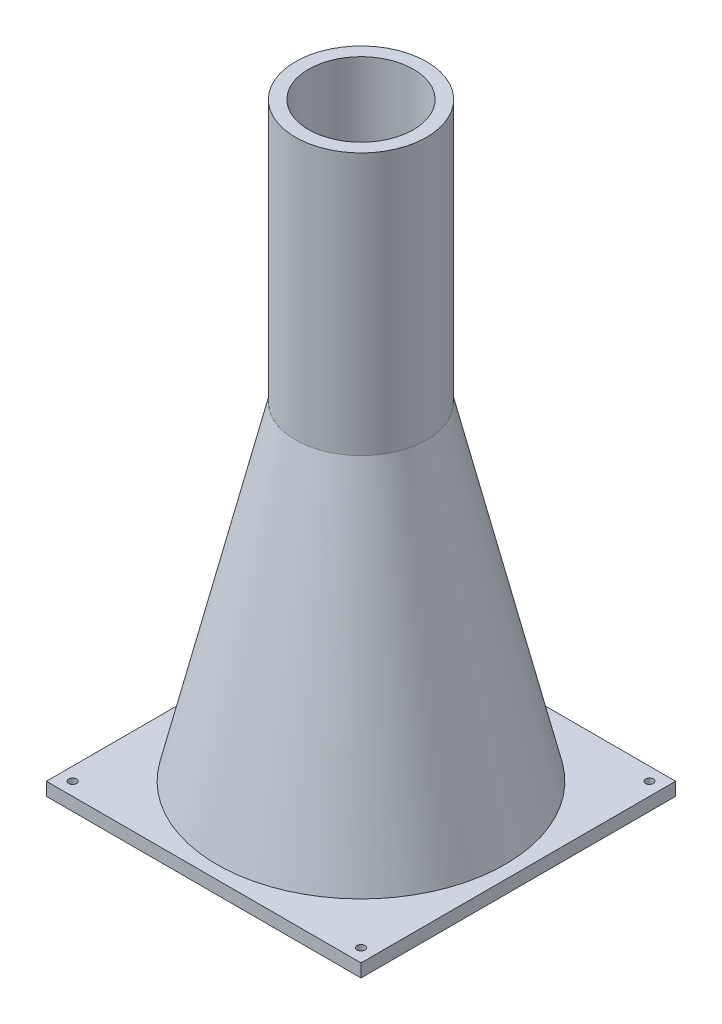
ISO-10303-21;
HEADER;
FILE_DESCRIPTION(('STEP AP214'),'2;1');
FILE_NAME('part.step','',(''),(''),'','','');
FILE_SCHEMA(('AUTOMOTIVE_DESIGN { 1 0 10303 214 1 1 1 1 }'));
ENDSEC;
DATA;
#1=APPLICATION_CONTEXT('core data for automotive mechanical design processes');
#2=APPLICATION_PROTOCOL_DEFINITION('international standard','automotive_design',2000,#1);
#3=PRODUCT_CONTEXT('',#1,'mechanical');
#4=PRODUCT('Part','Part','',(#3));
#5=PRODUCT_RELATED_PRODUCT_CATEGORY('part','',(#4));
#6=PRODUCT_DEFINITION_FORMATION('','',#4);
#7=PRODUCT_DEFINITION_CONTEXT('part definition',#1,'design');
#8=PRODUCT_DEFINITION('design','',#6,#7);
#9=PRODUCT_DEFINITION_SHAPE('','',#8);
#10=(LENGTH_UNIT() NAMED_UNIT(*) SI_UNIT(.MILLI.,.METRE.));
#11=(NAMED_UNIT(*) PLANE_ANGLE_UNIT() SI_UNIT($,.RADIAN.));
#12=(NAMED_UNIT(*) SI_UNIT($,.STERADIAN.) SOLID_ANGLE_UNIT());
#13=UNCERTAINTY_MEASURE_WITH_UNIT(LENGTH_MEASURE(1.E-05),#10,'distance_accuracy_value','');
#14=(GEOMETRIC_REPRESENTATION_CONTEXT(3) GLOBAL_UNCERTAINTY_ASSIGNED_CONTEXT((#13)) GLOBAL_UNIT_ASSIGNED_CONTEXT((#10,
#11,#12)) REPRESENTATION_CONTEXT('',''));
#15=CARTESIAN_POINT('',(0.,0.,0.));
#16=DIRECTION('',(0.,0.,1.));
#17=DIRECTION('',(1.,0.,0.));
#18=AXIS2_PLACEMENT_3D('',#15,#16,#17);
#19=CARTESIAN_POINT('',(-20.,225.212863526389,0.));
#20=DIRECTION('',(0.,-1.,0.));
#21=DIRECTION('',(0.,0.,-1.));
#22=AXIS2_PLACEMENT_3D('',#19,#20,#21);
#23=PLANE('',#22);
#24=CARTESIAN_POINT('',(0.,225.212863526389,0.));
#25=DIRECTION('',(0.,-1.,0.));
#26=DIRECTION('',(0.,0.,-1.));
#27=AXIS2_PLACEMENT_3D('',#24,#25,#26);
#28=CIRCLE('',#27,25.);
#29=CARTESIAN_POINT('',(0.,225.212863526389,-25.));
#30=VERTEX_POINT('',#29);
#31=EDGE_CURVE('E11',#30,#30,#28,.T.);
#32=ORIENTED_EDGE('',*,*,#31,.F.);
#33=EDGE_LOOP('',(#32));
#34=FACE_BOUND('',#33,.T.);
#35=CARTESIAN_POINT('',(0.,225.212863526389,0.));
#36=DIRECTION('',(0.,-1.,0.));
#37=DIRECTION('',(0.,0.,-1.));
#38=AXIS2_PLACEMENT_3D('',#35,#36,#37);
#39=CIRCLE('',#38,20.);
#40=CARTESIAN_POINT('',(0.,225.212863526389,-20.));
#41=VERTEX_POINT('',#40);
#42=EDGE_CURVE('E110',#41,#41,#39,.T.);
#43=ORIENTED_EDGE('',*,*,#42,.T.);
#44=EDGE_LOOP('',(#43));
#45=FACE_BOUND('',#44,.T.);
#46=ADVANCED_FACE('F33',(#34,#45),#23,.F.);
#47=CARTESIAN_POINT('',(0.,0.,0.));
#48=DIRECTION('',(0.,-1.,0.));
#49=DIRECTION('',(0.,0.,-1.));
#50=AXIS2_PLACEMENT_3D('',#47,#48,#49);
#51=CYLINDRICAL_SURFACE('',#50,25.);
#52=CARTESIAN_POINT('',(0.,125.212863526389,0.));
#53=DIRECTION('',(0.,-1.,0.));
#54=DIRECTION('',(0.,0.,-1.));
#55=AXIS2_PLACEMENT_3D('',#52,#53,#54);
#56=CIRCLE('',#55,25.);
#57=CARTESIAN_POINT('',(0.,125.212863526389,-25.));
#58=VERTEX_POINT('',#57);
#59=EDGE_CURVE('E41',#58,#58,#56,.T.);
#60=ORIENTED_EDGE('',*,*,#59,.F.);
#61=EDGE_LOOP('',(#60));
#62=FACE_BOUND('',#61,.T.);
#63=ORIENTED_EDGE('',*,*,#31,.T.);
#64=EDGE_LOOP('',(#63));
#65=FACE_BOUND('',#64,.T.);
#66=ADVANCED_FACE('F123',(#62,#65),#51,.T.);
#67=CARTESIAN_POINT('',(0.,125.212863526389,0.));
#68=DIRECTION('',(0.,-1.,0.));
#69=DIRECTION('',(0.,0.,-1.));
#70=AXIS2_PLACEMENT_3D('',#67,#68,#69);
#71=CONICAL_SURFACE('',#70,25.,0.235159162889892);
#72=CARTESIAN_POINT('',(0.,0.,0.));
#73=DIRECTION('',(0.,-1.,0.));
#74=DIRECTION('',(0.,0.,-1.));
#75=AXIS2_PLACEMENT_3D('',#72,#73,#74);
#76=CIRCLE('',#75,55.);
#77=CARTESIAN_POINT('',(0.,0.,-55.));
#78=VERTEX_POINT('',#77);
#79=EDGE_CURVE('E116',#78,#78,#76,.T.);
#80=ORIENTED_EDGE('',*,*,#79,.F.);
#81=EDGE_LOOP('',(#80));
#82=FACE_BOUND('',#81,.T.);
#83=ORIENTED_EDGE('',*,*,#59,.T.);
#84=EDGE_LOOP('',(#83));
#85=FACE_BOUND('',#84,.T.);
#86=ADVANCED_FACE('F121',(#82,#85),#71,.T.);
#87=CARTESIAN_POINT('',(0.,0.,0.));
#88=DIRECTION('',(0.,-1.,0.));
#89=DIRECTION('',(0.,0.,-1.));
#90=AXIS2_PLACEMENT_3D('',#87,#88,#89);
#91=CONICAL_SURFACE('',#90,50.,0.235159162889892);
#92=CARTESIAN_POINT('',(0.,125.212863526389,0.));
#93=DIRECTION('',(0.,-1.,0.));
#94=DIRECTION('',(0.,0.,-1.));
#95=AXIS2_PLACEMENT_3D('',#92,#93,#94);
#96=CIRCLE('',#95,20.);
#97=CARTESIAN_POINT('',(0.,125.212863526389,-20.));
#98=VERTEX_POINT('',#97);
#99=EDGE_CURVE('E113',#98,#98,#96,.T.);
#100=ORIENTED_EDGE('',*,*,#99,.F.);
#101=EDGE_LOOP('',(#100));
#102=FACE_BOUND('',#101,.T.);
#103=CARTESIAN_POINT('',(0.,0.,0.));
#104=DIRECTION('',(0.,1.,0.));
#105=DIRECTION('',(0.,0.,1.));
#106=AXIS2_PLACEMENT_3D('',#103,#104,#105);
#107=CIRCLE('',#106,50.);
#108=CARTESIAN_POINT('',(0.,0.,50.));
#109=VERTEX_POINT('',#108);
#110=EDGE_CURVE('E145',#109,#109,#107,.T.);
#111=ORIENTED_EDGE('',*,*,#110,.F.);
#112=EDGE_LOOP('',(#111));
#113=FACE_BOUND('',#112,.T.);
#114=ADVANCED_FACE('F136',(#102,#113),#91,.F.);
#115=CARTESIAN_POINT('',(0.,0.,0.));
#116=DIRECTION('',(0.,-1.,0.));
#117=DIRECTION('',(0.,0.,-1.));
#118=AXIS2_PLACEMENT_3D('',#115,#116,#117);
#119=CYLINDRICAL_SURFACE('',#118,20.);
#120=ORIENTED_EDGE('',*,*,#42,.F.);
#121=EDGE_LOOP('',(#120));
#122=FACE_BOUND('',#121,.T.);
#123=ORIENTED_EDGE('',*,*,#99,.T.);
#124=EDGE_LOOP('',(#123));
#125=FACE_BOUND('',#124,.T.);
#126=ADVANCED_FACE('F132',(#122,#125),#119,.F.);
#127=CARTESIAN_POINT('',(0.,0.,0.));
#128=DIRECTION('',(0.,1.,0.));
#129=DIRECTION('',(0.,0.,1.));
#130=AXIS2_PLACEMENT_3D('',#127,#128,#129);
#131=PLANE('',#130);
#132=CARTESIAN_POINT('',(-54.9999999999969,0.,-55.));
#133=DIRECTION('',(0.,-1.,0.));
#134=DIRECTION('',(0.,0.,-1.));
#135=AXIS2_PLACEMENT_3D('',#132,#133,#134);
#136=CIRCLE('',#135,1.50000000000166);
#137=CARTESIAN_POINT('',(-54.9999999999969,0.,-56.5000000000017));
#138=VERTEX_POINT('',#137);
#139=EDGE_CURVE('E166',#138,#138,#136,.T.);
#140=ORIENTED_EDGE('',*,*,#139,.T.);
#141=EDGE_LOOP('',(#140));
#142=FACE_BOUND('',#141,.T.);
#143=CARTESIAN_POINT('',(55.0000000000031,0.,-54.9999999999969));
#144=DIRECTION('',(0.,-1.,0.));
#145=DIRECTION('',(0.,0.,-1.));
#146=AXIS2_PLACEMENT_3D('',#143,#144,#145);
#147=CIRCLE('',#146,1.5000000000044);
#148=CARTESIAN_POINT('',(55.0000000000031,0.,-56.5000000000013));
#149=VERTEX_POINT('',#148);
#150=EDGE_CURVE('E160',#149,#149,#147,.T.);
#151=ORIENTED_EDGE('',*,*,#150,.T.);
#152=EDGE_LOOP('',(#151));
#153=FACE_BOUND('',#152,.T.);
#154=CARTESIAN_POINT('',(55.,0.,55.0000000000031));
#155=DIRECTION('',(0.,-1.,0.));
#156=DIRECTION('',(0.,0.,-1.));
#157=AXIS2_PLACEMENT_3D('',#154,#155,#156);
#158=CIRCLE('',#157,1.50000000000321);
#159=CARTESIAN_POINT('',(55.,0.,53.4999999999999));
#160=VERTEX_POINT('',#159);
#161=EDGE_CURVE('E153',#160,#160,#158,.T.);
#162=ORIENTED_EDGE('',*,*,#161,.T.);
#163=EDGE_LOOP('',(#162));
#164=FACE_BOUND('',#163,.T.);
#165=CARTESIAN_POINT('',(-55.,0.,55.));
#166=DIRECTION('',(0.,-1.,0.));
#167=DIRECTION('',(0.,0.,-1.));
#168=AXIS2_PLACEMENT_3D('',#165,#166,#167);
#169=CIRCLE('',#168,1.5);
#170=CARTESIAN_POINT('',(-55.,0.,53.5));
#171=VERTEX_POINT('',#170);
#172=EDGE_CURVE('E103',#171,#171,#169,.T.);
#173=ORIENTED_EDGE('',*,*,#172,.T.);
#174=EDGE_LOOP('',(#173));
#175=FACE_BOUND('',#174,.T.);
#176=ORIENTED_EDGE('',*,*,#79,.T.);
#177=EDGE_LOOP('',(#176));
#178=FACE_BOUND('',#177,.T.);
#179=DIRECTION('',(0.,0.,1.));
#180=VECTOR('',#179,1.);
#181=CARTESIAN_POINT('',(60.,0.,-60.));
#182=LINE('',#181,#180);
#183=CARTESIAN_POINT('',(60.,0.,-60.));
#184=VERTEX_POINT('',#183);
#185=CARTESIAN_POINT('',(60.,0.,60.));
#186=VERTEX_POINT('',#185);
#187=EDGE_CURVE('E100',#184,#186,#182,.T.);
#188=ORIENTED_EDGE('',*,*,#187,.F.);
#189=DIRECTION('',(1.,0.,0.));
#190=VECTOR('',#189,1.);
#191=CARTESIAN_POINT('',(-60.,0.,-60.));
#192=LINE('',#191,#190);
#193=CARTESIAN_POINT('',(-60.,0.,-60.));
#194=VERTEX_POINT('',#193);
#195=EDGE_CURVE('E72',#194,#184,#192,.T.);
#196=ORIENTED_EDGE('',*,*,#195,.F.);
#197=DIRECTION('',(0.,0.,-1.));
#198=VECTOR('',#197,1.);
#199=CARTESIAN_POINT('',(-60.,0.,-60.));
#200=LINE('',#199,#198);
#201=CARTESIAN_POINT('',(-60.,0.,60.));
#202=VERTEX_POINT('',#201);
#203=EDGE_CURVE('E66',#202,#194,#200,.T.);
#204=ORIENTED_EDGE('',*,*,#203,.F.);
#205=DIRECTION('',(-1.,0.,0.));
#206=VECTOR('',#205,1.);
#207=CARTESIAN_POINT('',(-60.,0.,60.));
#208=LINE('',#207,#206);
#209=EDGE_CURVE('E90',#186,#202,#208,.T.);
#210=ORIENTED_EDGE('',*,*,#209,.F.);
#211=EDGE_LOOP('',(#188,#196,#204,#210));
#212=FACE_BOUND('',#211,.T.);
#213=ADVANCED_FACE('F135',(#142,#153,#164,#175,#178,#212),#131,.T.);
#214=CARTESIAN_POINT('',(0.,-5.,0.));
#215=DIRECTION('',(0.,1.,0.));
#216=DIRECTION('',(0.,0.,1.));
#217=AXIS2_PLACEMENT_3D('',#214,#215,#216);
#218=PLANE('',#217);
#219=CARTESIAN_POINT('',(0.,-5.,0.));
#220=DIRECTION('',(0.,1.,0.));
#221=DIRECTION('',(0.,0.,1.));
#222=AXIS2_PLACEMENT_3D('',#219,#220,#221);
#223=CIRCLE('',#222,50.);
#224=CARTESIAN_POINT('',(0.,-5.,50.));
#225=VERTEX_POINT('',#224);
#226=EDGE_CURVE('E147',#225,#225,#223,.T.);
#227=ORIENTED_EDGE('',*,*,#226,.T.);
#228=EDGE_LOOP('',(#227));
#229=FACE_BOUND('',#228,.T.);
#230=CARTESIAN_POINT('',(-54.9999999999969,-5.,-55.));
#231=DIRECTION('',(0.,-1.,0.));
#232=DIRECTION('',(0.,0.,-1.));
#233=AXIS2_PLACEMENT_3D('',#230,#231,#232);
#234=CIRCLE('',#233,1.50000000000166);
#235=CARTESIAN_POINT('',(-54.9999999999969,-5.,-56.5000000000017));
#236=VERTEX_POINT('',#235);
#237=EDGE_CURVE('E150',#236,#236,#234,.T.);
#238=ORIENTED_EDGE('',*,*,#237,.F.);
#239=EDGE_LOOP('',(#238));
#240=FACE_BOUND('',#239,.T.);
#241=CARTESIAN_POINT('',(55.0000000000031,-5.,-54.9999999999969));
#242=DIRECTION('',(0.,-1.,0.));
#243=DIRECTION('',(0.,0.,-1.));
#244=AXIS2_PLACEMENT_3D('',#241,#242,#243);
#245=CIRCLE('',#244,1.5000000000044);
#246=CARTESIAN_POINT('',(55.0000000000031,-5.,-56.5000000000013));
#247=VERTEX_POINT('',#246);
#248=EDGE_CURVE('E163',#247,#247,#245,.T.);
#249=ORIENTED_EDGE('',*,*,#248,.F.);
#250=EDGE_LOOP('',(#249));
#251=FACE_BOUND('',#250,.T.);
#252=CARTESIAN_POINT('',(55.,-5.,55.0000000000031));
#253=DIRECTION('',(0.,-1.,0.));
#254=DIRECTION('',(0.,0.,-1.));
#255=AXIS2_PLACEMENT_3D('',#252,#253,#254);
#256=CIRCLE('',#255,1.50000000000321);
#257=CARTESIAN_POINT('',(55.,-5.,53.4999999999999));
#258=VERTEX_POINT('',#257);
#259=EDGE_CURVE('E157',#258,#258,#256,.T.);
#260=ORIENTED_EDGE('',*,*,#259,.F.);
#261=EDGE_LOOP('',(#260));
#262=FACE_BOUND('',#261,.T.);
#263=CARTESIAN_POINT('',(-55.,-5.,55.));
#264=DIRECTION('',(0.,-1.,0.));
#265=DIRECTION('',(0.,0.,-1.));
#266=AXIS2_PLACEMENT_3D('',#263,#264,#265);
#267=CIRCLE('',#266,1.5);
#268=CARTESIAN_POINT('',(-55.,-5.,53.5));
#269=VERTEX_POINT('',#268);
#270=EDGE_CURVE('E156',#269,#269,#267,.T.);
#271=ORIENTED_EDGE('',*,*,#270,.F.);
#272=EDGE_LOOP('',(#271));
#273=FACE_BOUND('',#272,.T.);
#274=DIRECTION('',(0.,0.,1.));
#275=VECTOR('',#274,1.);
#276=CARTESIAN_POINT('',(60.,-5.,-60.));
#277=LINE('',#276,#275);
#278=CARTESIAN_POINT('',(60.,-5.,-60.));
#279=VERTEX_POINT('',#278);
#280=CARTESIAN_POINT('',(60.,-5.,60.));
#281=VERTEX_POINT('',#280);
#282=EDGE_CURVE('E85',#279,#281,#277,.T.);
#283=ORIENTED_EDGE('',*,*,#282,.T.);
#284=DIRECTION('',(-1.,0.,0.));
#285=VECTOR('',#284,1.);
#286=CARTESIAN_POINT('',(-60.,-5.,60.));
#287=LINE('',#286,#285);
#288=CARTESIAN_POINT('',(-60.,-5.,60.));
#289=VERTEX_POINT('',#288);
#290=EDGE_CURVE('E80',#281,#289,#287,.T.);
#291=ORIENTED_EDGE('',*,*,#290,.T.);
#292=DIRECTION('',(0.,0.,-1.));
#293=VECTOR('',#292,1.);
#294=CARTESIAN_POINT('',(-60.,-5.,-60.));
#295=LINE('',#294,#293);
#296=CARTESIAN_POINT('',(-60.,-5.,-60.));
#297=VERTEX_POINT('',#296);
#298=EDGE_CURVE('E83',#289,#297,#295,.T.);
#299=ORIENTED_EDGE('',*,*,#298,.T.);
#300=DIRECTION('',(1.,0.,0.));
#301=VECTOR('',#300,1.);
#302=CARTESIAN_POINT('',(-60.,-5.,-60.));
#303=LINE('',#302,#301);
#304=EDGE_CURVE('E49',#297,#279,#303,.T.);
#305=ORIENTED_EDGE('',*,*,#304,.T.);
#306=EDGE_LOOP('',(#283,#291,#299,#305));
#307=FACE_BOUND('',#306,.T.);
#308=ADVANCED_FACE('F81',(#229,#240,#251,#262,#273,#307),#218,.F.);
#309=CARTESIAN_POINT('',(-60.,-5.,-60.));
#310=DIRECTION('',(0.,0.,1.));
#311=DIRECTION('',(1.,0.,0.));
#312=AXIS2_PLACEMENT_3D('',#309,#310,#311);
#313=PLANE('',#312);
#314=ORIENTED_EDGE('',*,*,#195,.T.);
#315=DIRECTION('',(0.,1.,0.));
#316=VECTOR('',#315,1.);
#317=CARTESIAN_POINT('',(60.,-5.,-60.));
#318=LINE('',#317,#316);
#319=EDGE_CURVE('E96',#279,#184,#318,.T.);
#320=ORIENTED_EDGE('',*,*,#319,.F.);
#321=ORIENTED_EDGE('',*,*,#304,.F.);
#322=DIRECTION('',(0.,1.,0.));
#323=VECTOR('',#322,1.);
#324=CARTESIAN_POINT('',(-60.,-5.,-60.));
#325=LINE('',#324,#323);
#326=EDGE_CURVE('E92',#297,#194,#325,.T.);
#327=ORIENTED_EDGE('',*,*,#326,.T.);
#328=EDGE_LOOP('',(#314,#320,#321,#327));
#329=FACE_BOUND('',#328,.T.);
#330=ADVANCED_FACE('F179',(#329),#313,.F.);
#331=CARTESIAN_POINT('',(-60.,-5.,-60.));
#332=DIRECTION('',(1.,0.,0.));
#333=DIRECTION('',(0.,0.,-1.));
#334=AXIS2_PLACEMENT_3D('',#331,#332,#333);
#335=PLANE('',#334);
#336=ORIENTED_EDGE('',*,*,#203,.T.);
#337=ORIENTED_EDGE('',*,*,#326,.F.);
#338=ORIENTED_EDGE('',*,*,#298,.F.);
#339=DIRECTION('',(0.,1.,0.));
#340=VECTOR('',#339,1.);
#341=CARTESIAN_POINT('',(-60.,-5.,60.));
#342=LINE('',#341,#340);
#343=EDGE_CURVE('E88',#289,#202,#342,.T.);
#344=ORIENTED_EDGE('',*,*,#343,.T.);
#345=EDGE_LOOP('',(#336,#337,#338,#344));
#346=FACE_BOUND('',#345,.T.);
#347=ADVANCED_FACE('F94',(#346),#335,.F.);
#348=CARTESIAN_POINT('',(-60.,-5.,60.));
#349=DIRECTION('',(0.,0.,-1.));
#350=DIRECTION('',(-1.,0.,0.));
#351=AXIS2_PLACEMENT_3D('',#348,#349,#350);
#352=PLANE('',#351);
#353=ORIENTED_EDGE('',*,*,#209,.T.);
#354=ORIENTED_EDGE('',*,*,#343,.F.);
#355=ORIENTED_EDGE('',*,*,#290,.F.);
#356=DIRECTION('',(0.,1.,0.));
#357=VECTOR('',#356,1.);
#358=CARTESIAN_POINT('',(60.,-5.,60.));
#359=LINE('',#358,#357);
#360=EDGE_CURVE('E91',#281,#186,#359,.T.);
#361=ORIENTED_EDGE('',*,*,#360,.T.);
#362=EDGE_LOOP('',(#353,#354,#355,#361));
#363=FACE_BOUND('',#362,.T.);
#364=ADVANCED_FACE('F89',(#363),#352,.F.);
#365=CARTESIAN_POINT('',(60.,-5.,-60.));
#366=DIRECTION('',(-1.,0.,0.));
#367=DIRECTION('',(0.,0.,1.));
#368=AXIS2_PLACEMENT_3D('',#365,#366,#367);
#369=PLANE('',#368);
#370=ORIENTED_EDGE('',*,*,#187,.T.);
#371=ORIENTED_EDGE('',*,*,#360,.F.);
#372=ORIENTED_EDGE('',*,*,#282,.F.);
#373=ORIENTED_EDGE('',*,*,#319,.T.);
#374=EDGE_LOOP('',(#370,#371,#372,#373));
#375=FACE_BOUND('',#374,.T.);
#376=ADVANCED_FACE('F197',(#375),#369,.F.);
#377=CARTESIAN_POINT('',(-55.,0.,55.));
#378=DIRECTION('',(0.,-1.,0.));
#379=DIRECTION('',(0.,0.,-1.));
#380=AXIS2_PLACEMENT_3D('',#377,#378,#379);
#381=CYLINDRICAL_SURFACE('',#380,1.5);
#382=ORIENTED_EDGE('',*,*,#172,.F.);
#383=EDGE_LOOP('',(#382));
#384=FACE_BOUND('',#383,.T.);
#385=ORIENTED_EDGE('',*,*,#270,.T.);
#386=EDGE_LOOP('',(#385));
#387=FACE_BOUND('',#386,.T.);
#388=ADVANCED_FACE('F176',(#384,#387),#381,.F.);
#389=CARTESIAN_POINT('',(55.,0.,55.0000000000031));
#390=DIRECTION('',(0.,-1.,0.));
#391=DIRECTION('',(0.,0.,-1.));
#392=AXIS2_PLACEMENT_3D('',#389,#390,#391);
#393=CYLINDRICAL_SURFACE('',#392,1.50000000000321);
#394=ORIENTED_EDGE('',*,*,#161,.F.);
#395=EDGE_LOOP('',(#394));
#396=FACE_BOUND('',#395,.T.);
#397=ORIENTED_EDGE('',*,*,#259,.T.);
#398=EDGE_LOOP('',(#397));
#399=FACE_BOUND('',#398,.T.);
#400=ADVANCED_FACE('F238',(#396,#399),#393,.F.);
#401=CARTESIAN_POINT('',(55.0000000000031,0.,-54.9999999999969));
#402=DIRECTION('',(0.,-1.,0.));
#403=DIRECTION('',(0.,0.,-1.));
#404=AXIS2_PLACEMENT_3D('',#401,#402,#403);
#405=CYLINDRICAL_SURFACE('',#404,1.5000000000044);
#406=ORIENTED_EDGE('',*,*,#150,.F.);
#407=EDGE_LOOP('',(#406));
#408=FACE_BOUND('',#407,.T.);
#409=ORIENTED_EDGE('',*,*,#248,.T.);
#410=EDGE_LOOP('',(#409));
#411=FACE_BOUND('',#410,.T.);
#412=ADVANCED_FACE('F247',(#408,#411),#405,.F.);
#413=CARTESIAN_POINT('',(-54.9999999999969,0.,-55.));
#414=DIRECTION('',(0.,-1.,0.));
#415=DIRECTION('',(0.,0.,-1.));
#416=AXIS2_PLACEMENT_3D('',#413,#414,#415);
#417=CYLINDRICAL_SURFACE('',#416,1.50000000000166);
#418=ORIENTED_EDGE('',*,*,#139,.F.);
#419=EDGE_LOOP('',(#418));
#420=FACE_BOUND('',#419,.T.);
#421=ORIENTED_EDGE('',*,*,#237,.T.);
#422=EDGE_LOOP('',(#421));
#423=FACE_BOUND('',#422,.T.);
#424=ADVANCED_FACE('F257',(#420,#423),#417,.F.);
#425=CARTESIAN_POINT('',(0.,-5.,0.));
#426=DIRECTION('',(0.,1.,0.));
#427=DIRECTION('',(0.,0.,1.));
#428=AXIS2_PLACEMENT_3D('',#425,#426,#427);
#429=CYLINDRICAL_SURFACE('',#428,50.);
#430=ORIENTED_EDGE('',*,*,#226,.F.);
#431=EDGE_LOOP('',(#430));
#432=FACE_BOUND('',#431,.T.);
#433=ORIENTED_EDGE('',*,*,#110,.T.);
#434=EDGE_LOOP('',(#433));
#435=FACE_BOUND('',#434,.T.);
#436=ADVANCED_FACE('F266',(#432,#435),#429,.F.);
#437=CLOSED_SHELL('',(#46,#66,#86,#114,#126,#213,#308,#330,#347,#364,#376,#388,#400,#412,#424,#436));
#438=MANIFOLD_SOLID_BREP('B2',#437);
#439=ADVANCED_BREP_SHAPE_REPRESENTATION('',(#18,#438),#14);
#440=SHAPE_DEFINITION_REPRESENTATION(#9,#439);
ENDSEC;
END-ISO-10303-21;
